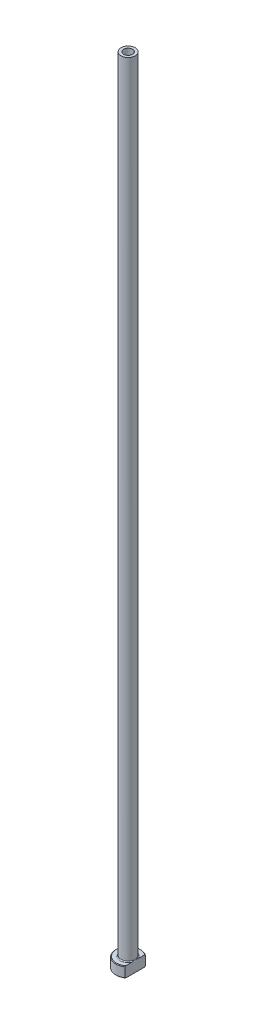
from build123d import *

# Parameters (mm, degrees)
CHAMFER1_SIZE      = 0.254
CUT_EXTRUDE1_REACH = 357.687


with BuildPart() as part:
    # Sketch1 → Revolve1 (revolve)
    with BuildSketch(Plane.XY, mode=Mode.PRIVATE) as revolve1_sk:
        with BuildLine():
            Line((0, 0), (5.5499, 0))
            Line((5.5499, 0), (5.5499, 4.7498))
            Line((5.5499, 4.7498), (3.565525, 4.7498))
            ThreePointArc((3.565525, 4.7498), (3.284891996, 4.866041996), (3.16865, 5.146675))
            Line((3.16865, 5.146675), (3.16865, 355.6))
            Line((3.16865, 355.6), (0, 355.6))
            Line((0, 355.6), (0, 0))
        make_face()
    revolve(revolve1_sk.sketch.rotate(Axis((0, 0, 0), (0, 1, 0)), 90), axis=Axis((0, 0, 0), (0, 1, 0)))

    # Sketch2 → Cut-Revolve1 (revolve, cut)
    with BuildSketch(Plane.XY, mode=Mode.PRIVATE) as cut_revolve1_sk:
        Polygon((2.571115, 0), (2.17424, 0.396875), (2.17424, 281.1145), (1.98374, 295.402), (1.98374, 355.6), (0, 355.6), (0, 0), align=None)
    revolve(cut_revolve1_sk.sketch.rotate(Axis((0, 0, 0), (0, 1, 0)), 90), axis=Axis((0, 0, 0), (0, 1, 0)), mode=Mode.SUBTRACT)

    # Chamfer1
    chamfer1_edges = [part.edges().sort_by_distance(p)[0] for p in [
        (0, 4.7498, 5.5499),
        (0, 0, 5.5499),
    ]]
    chamfer(chamfer1_edges, length=CHAMFER1_SIZE)

    # Sketch3 → Cut-Extrude1 (cut, up to next)
    with BuildSketch(Plane.XZ, mode=Mode.PRIVATE) as cut_extrude1_sk1:
        with BuildLine():
            Line((3.16865, 4.556429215), (3.16865, -4.556429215))
            ThreePointArc((3.16865, -4.556429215), (5.5499, 0), (3.16865, 4.556429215))
        make_face()
    cut_extrude1_tool1 = extrude(cut_extrude1_sk1.sketch, amount=-CUT_EXTRUDE1_REACH, mode=Mode.PRIVATE) & part.part
    add(cut_extrude1_tool1.solids().sort_by_distance((4.141174, 0, 0))[0], mode=Mode.SUBTRACT)


solid = part.part
